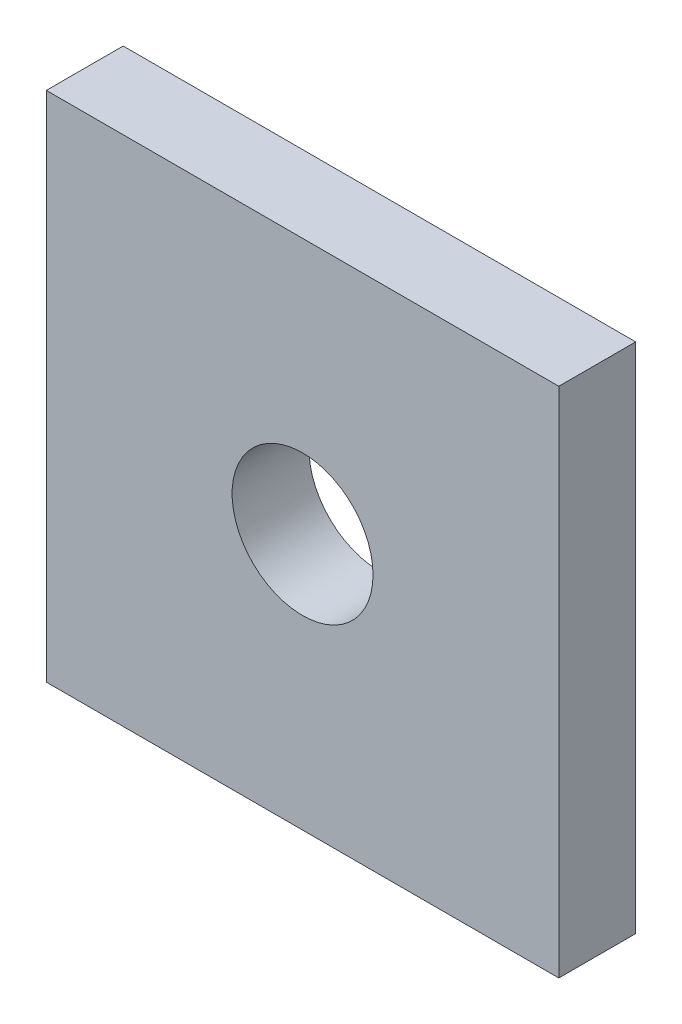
ISO-10303-21;
HEADER;
FILE_DESCRIPTION(('STEP AP214'),'2;1');
FILE_NAME('part.step','',(''),(''),'','','');
FILE_SCHEMA(('AUTOMOTIVE_DESIGN { 1 0 10303 214 1 1 1 1 }'));
ENDSEC;
DATA;
#1=APPLICATION_CONTEXT('core data for automotive mechanical design processes');
#2=APPLICATION_PROTOCOL_DEFINITION('international standard','automotive_design',2000,#1);
#3=PRODUCT_CONTEXT('',#1,'mechanical');
#4=PRODUCT('Part','Part','',(#3));
#5=PRODUCT_RELATED_PRODUCT_CATEGORY('part','',(#4));
#6=PRODUCT_DEFINITION_FORMATION('','',#4);
#7=PRODUCT_DEFINITION_CONTEXT('part definition',#1,'design');
#8=PRODUCT_DEFINITION('design','',#6,#7);
#9=PRODUCT_DEFINITION_SHAPE('','',#8);
#10=(LENGTH_UNIT() NAMED_UNIT(*) SI_UNIT(.MILLI.,.METRE.));
#11=(NAMED_UNIT(*) PLANE_ANGLE_UNIT() SI_UNIT($,.RADIAN.));
#12=(NAMED_UNIT(*) SI_UNIT($,.STERADIAN.) SOLID_ANGLE_UNIT());
#13=UNCERTAINTY_MEASURE_WITH_UNIT(LENGTH_MEASURE(1.E-05),#10,'distance_accuracy_value','');
#14=(GEOMETRIC_REPRESENTATION_CONTEXT(3) GLOBAL_UNCERTAINTY_ASSIGNED_CONTEXT((#13)) GLOBAL_UNIT_ASSIGNED_CONTEXT((#10,
#11,#12)) REPRESENTATION_CONTEXT('',''));
#15=CARTESIAN_POINT('',(0.,0.,0.));
#16=DIRECTION('',(0.,0.,1.));
#17=DIRECTION('',(1.,0.,0.));
#18=AXIS2_PLACEMENT_3D('',#15,#16,#17);
#19=CARTESIAN_POINT('',(0.,20.,3.));
#20=DIRECTION('',(0.,0.,-1.));
#21=DIRECTION('',(-1.,0.,0.));
#22=AXIS2_PLACEMENT_3D('',#19,#20,#21);
#23=PLANE('',#22);
#24=DIRECTION('',(0.,-1.,0.));
#25=VECTOR('',#24,1.);
#26=CARTESIAN_POINT('',(0.,0.,3.));
#27=LINE('',#26,#25);
#28=CARTESIAN_POINT('',(0.,20.,3.));
#29=VERTEX_POINT('',#28);
#30=CARTESIAN_POINT('',(0.,0.,3.));
#31=VERTEX_POINT('',#30);
#32=EDGE_CURVE('E83',#29,#31,#27,.T.);
#33=ORIENTED_EDGE('',*,*,#32,.T.);
#34=DIRECTION('',(1.,0.,0.));
#35=VECTOR('',#34,1.);
#36=CARTESIAN_POINT('',(0.,0.,3.));
#37=LINE('',#36,#35);
#38=CARTESIAN_POINT('',(20.,0.,3.));
#39=VERTEX_POINT('',#38);
#40=EDGE_CURVE('E78',#31,#39,#37,.T.);
#41=ORIENTED_EDGE('',*,*,#40,.T.);
#42=DIRECTION('',(0.,1.,0.));
#43=VECTOR('',#42,1.);
#44=CARTESIAN_POINT('',(20.,0.,3.));
#45=LINE('',#44,#43);
#46=CARTESIAN_POINT('',(20.,20.,3.));
#47=VERTEX_POINT('',#46);
#48=EDGE_CURVE('E81',#39,#47,#45,.T.);
#49=ORIENTED_EDGE('',*,*,#48,.T.);
#50=DIRECTION('',(-1.,0.,0.));
#51=VECTOR('',#50,1.);
#52=CARTESIAN_POINT('',(0.,20.,3.));
#53=LINE('',#52,#51);
#54=EDGE_CURVE('E48',#47,#29,#53,.T.);
#55=ORIENTED_EDGE('',*,*,#54,.T.);
#56=EDGE_LOOP('',(#33,#41,#49,#55));
#57=FACE_BOUND('',#56,.T.);
#58=CARTESIAN_POINT('',(10.,10.,3.));
#59=DIRECTION('',(0.,0.,1.));
#60=DIRECTION('',(1.,0.,0.));
#61=AXIS2_PLACEMENT_3D('',#58,#59,#60);
#62=CIRCLE('',#61,2.75);
#63=CARTESIAN_POINT('',(12.75,10.,3.));
#64=VERTEX_POINT('',#63);
#65=EDGE_CURVE('E98',#64,#64,#62,.T.);
#66=ORIENTED_EDGE('',*,*,#65,.F.);
#67=EDGE_LOOP('',(#66));
#68=FACE_BOUND('',#67,.T.);
#69=ADVANCED_FACE('F31',(#57,#68),#23,.F.);
#70=CARTESIAN_POINT('',(0.,20.,0.));
#71=DIRECTION('',(0.,0.,-1.));
#72=DIRECTION('',(-1.,0.,0.));
#73=AXIS2_PLACEMENT_3D('',#70,#71,#72);
#74=PLANE('',#73);
#75=DIRECTION('',(0.,-1.,0.));
#76=VECTOR('',#75,1.);
#77=CARTESIAN_POINT('',(0.,0.,0.));
#78=LINE('',#77,#76);
#79=CARTESIAN_POINT('',(0.,20.,0.));
#80=VERTEX_POINT('',#79);
#81=CARTESIAN_POINT('',(0.,0.,0.));
#82=VERTEX_POINT('',#81);
#83=EDGE_CURVE('E95',#80,#82,#78,.T.);
#84=ORIENTED_EDGE('',*,*,#83,.F.);
#85=DIRECTION('',(-1.,0.,0.));
#86=VECTOR('',#85,1.);
#87=CARTESIAN_POINT('',(0.,20.,0.));
#88=LINE('',#87,#86);
#89=CARTESIAN_POINT('',(20.,20.,0.));
#90=VERTEX_POINT('',#89);
#91=EDGE_CURVE('E71',#90,#80,#88,.T.);
#92=ORIENTED_EDGE('',*,*,#91,.F.);
#93=DIRECTION('',(0.,1.,0.));
#94=VECTOR('',#93,1.);
#95=CARTESIAN_POINT('',(20.,0.,0.));
#96=LINE('',#95,#94);
#97=CARTESIAN_POINT('',(20.,0.,0.));
#98=VERTEX_POINT('',#97);
#99=EDGE_CURVE('E65',#98,#90,#96,.T.);
#100=ORIENTED_EDGE('',*,*,#99,.F.);
#101=DIRECTION('',(1.,0.,0.));
#102=VECTOR('',#101,1.);
#103=CARTESIAN_POINT('',(0.,0.,0.));
#104=LINE('',#103,#102);
#105=EDGE_CURVE('E87',#82,#98,#104,.T.);
#106=ORIENTED_EDGE('',*,*,#105,.F.);
#107=EDGE_LOOP('',(#84,#92,#100,#106));
#108=FACE_BOUND('',#107,.T.);
#109=CARTESIAN_POINT('',(10.,10.,0.));
#110=DIRECTION('',(0.,0.,1.));
#111=DIRECTION('',(1.,0.,0.));
#112=AXIS2_PLACEMENT_3D('',#109,#110,#111);
#113=CIRCLE('',#112,2.75);
#114=CARTESIAN_POINT('',(12.75,10.,0.));
#115=VERTEX_POINT('',#114);
#116=EDGE_CURVE('E110',#115,#115,#113,.T.);
#117=ORIENTED_EDGE('',*,*,#116,.T.);
#118=EDGE_LOOP('',(#117));
#119=FACE_BOUND('',#118,.T.);
#120=ADVANCED_FACE('F106',(#108,#119),#74,.T.);
#121=CARTESIAN_POINT('',(0.,0.,3.));
#122=DIRECTION('',(1.,0.,0.));
#123=DIRECTION('',(0.,0.,-1.));
#124=AXIS2_PLACEMENT_3D('',#121,#122,#123);
#125=PLANE('',#124);
#126=ORIENTED_EDGE('',*,*,#83,.T.);
#127=DIRECTION('',(0.,0.,-1.));
#128=VECTOR('',#127,1.);
#129=CARTESIAN_POINT('',(0.,0.,3.));
#130=LINE('',#129,#128);
#131=EDGE_CURVE('E11',#31,#82,#130,.T.);
#132=ORIENTED_EDGE('',*,*,#131,.F.);
#133=ORIENTED_EDGE('',*,*,#32,.F.);
#134=DIRECTION('',(0.,0.,-1.));
#135=VECTOR('',#134,1.);
#136=CARTESIAN_POINT('',(0.,20.,3.));
#137=LINE('',#136,#135);
#138=EDGE_CURVE('E91',#29,#80,#137,.T.);
#139=ORIENTED_EDGE('',*,*,#138,.T.);
#140=EDGE_LOOP('',(#126,#132,#133,#139));
#141=FACE_BOUND('',#140,.T.);
#142=ADVANCED_FACE('F33',(#141),#125,.F.);
#143=CARTESIAN_POINT('',(0.,0.,3.));
#144=DIRECTION('',(0.,1.,0.));
#145=DIRECTION('',(0.,0.,1.));
#146=AXIS2_PLACEMENT_3D('',#143,#144,#145);
#147=PLANE('',#146);
#148=ORIENTED_EDGE('',*,*,#105,.T.);
#149=DIRECTION('',(0.,0.,-1.));
#150=VECTOR('',#149,1.);
#151=CARTESIAN_POINT('',(20.,0.,3.));
#152=LINE('',#151,#150);
#153=EDGE_CURVE('E40',#39,#98,#152,.T.);
#154=ORIENTED_EDGE('',*,*,#153,.F.);
#155=ORIENTED_EDGE('',*,*,#40,.F.);
#156=ORIENTED_EDGE('',*,*,#131,.T.);
#157=EDGE_LOOP('',(#148,#154,#155,#156));
#158=FACE_BOUND('',#157,.T.);
#159=ADVANCED_FACE('F86',(#158),#147,.F.);
#160=CARTESIAN_POINT('',(20.,0.,3.));
#161=DIRECTION('',(-1.,0.,0.));
#162=DIRECTION('',(0.,0.,1.));
#163=AXIS2_PLACEMENT_3D('',#160,#161,#162);
#164=PLANE('',#163);
#165=ORIENTED_EDGE('',*,*,#99,.T.);
#166=DIRECTION('',(0.,0.,-1.));
#167=VECTOR('',#166,1.);
#168=CARTESIAN_POINT('',(20.,20.,3.));
#169=LINE('',#168,#167);
#170=EDGE_CURVE('E88',#47,#90,#169,.T.);
#171=ORIENTED_EDGE('',*,*,#170,.F.);
#172=ORIENTED_EDGE('',*,*,#48,.F.);
#173=ORIENTED_EDGE('',*,*,#153,.T.);
#174=EDGE_LOOP('',(#165,#171,#172,#173));
#175=FACE_BOUND('',#174,.T.);
#176=ADVANCED_FACE('F89',(#175),#164,.F.);
#177=CARTESIAN_POINT('',(0.,20.,3.));
#178=DIRECTION('',(0.,-1.,0.));
#179=DIRECTION('',(0.,0.,-1.));
#180=AXIS2_PLACEMENT_3D('',#177,#178,#179);
#181=PLANE('',#180);
#182=ORIENTED_EDGE('',*,*,#91,.T.);
#183=ORIENTED_EDGE('',*,*,#138,.F.);
#184=ORIENTED_EDGE('',*,*,#54,.F.);
#185=ORIENTED_EDGE('',*,*,#170,.T.);
#186=EDGE_LOOP('',(#182,#183,#184,#185));
#187=FACE_BOUND('',#186,.T.);
#188=ADVANCED_FACE('F103',(#187),#181,.F.);
#189=CARTESIAN_POINT('',(10.,10.,3.));
#190=DIRECTION('',(0.,0.,-1.));
#191=DIRECTION('',(-1.,0.,0.));
#192=AXIS2_PLACEMENT_3D('',#189,#190,#191);
#193=CYLINDRICAL_SURFACE('',#192,2.75);
#194=ORIENTED_EDGE('',*,*,#65,.T.);
#195=EDGE_LOOP('',(#194));
#196=FACE_BOUND('',#195,.T.);
#197=ORIENTED_EDGE('',*,*,#116,.F.);
#198=EDGE_LOOP('',(#197));
#199=FACE_BOUND('',#198,.T.);
#200=ADVANCED_FACE('F116',(#196,#199),#193,.F.);
#201=CLOSED_SHELL('',(#69,#120,#142,#159,#176,#188,#200));
#202=MANIFOLD_SOLID_BREP('B2',#201);
#203=ADVANCED_BREP_SHAPE_REPRESENTATION('',(#18,#202),#14);
#204=SHAPE_DEFINITION_REPRESENTATION(#9,#203);
ENDSEC;
END-ISO-10303-21;
